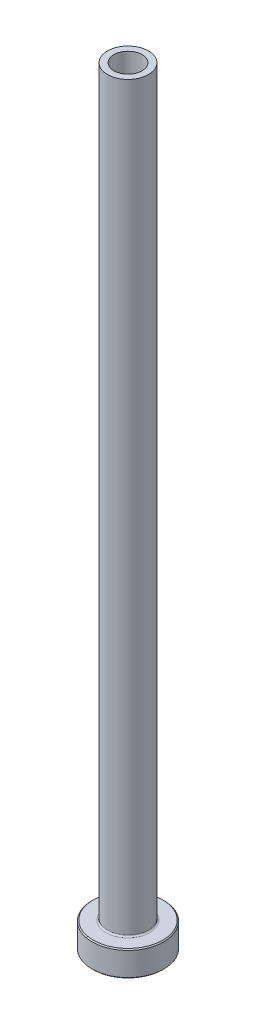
from build123d import *

# Parameters (mm, degrees)
FILLET1_R     = 0.3
CHAMFER1_SIZE = 0.2
CHAMFER3_SIZE = 0.5


with BuildPart() as part:
    # Sketch1 → Revolve1 (revolve)
    with BuildSketch(Plane.XY, mode=Mode.PRIVATE) as revolve1_sk:
        Polygon((-2.75, 150), (-4, 150), (-4, 5), (-7, 5), (-7, 0), (-3, 0), (-3, 93), (-2.75, 105), align=None)
    revolve(revolve1_sk.sketch.rotate(Axis((0, 92.187680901, 0), (0, -1, 0)), 270), axis=Axis((0, 92.187680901, 0), (0, -1, 0)))

    # Fillet1
    fillet1_edges = [part.edges().sort_by_distance(p)[0] for p in [
        (0, 5, -4),
    ]]
    fillet(fillet1_edges, radius=FILLET1_R)

    # Chamfer1
    chamfer1_edges = [part.edges().sort_by_distance(p)[0] for p in [
        (0, 0, -7),
        (0, 5, -7),
    ]]
    chamfer(chamfer1_edges, length=CHAMFER1_SIZE)

    # Chamfer3
    chamfer3_edges = [part.edges().sort_by_distance(p)[0] for p in [
        (0, 0, -3),
    ]]
    chamfer(chamfer3_edges, length=CHAMFER3_SIZE)


solid = part.part
